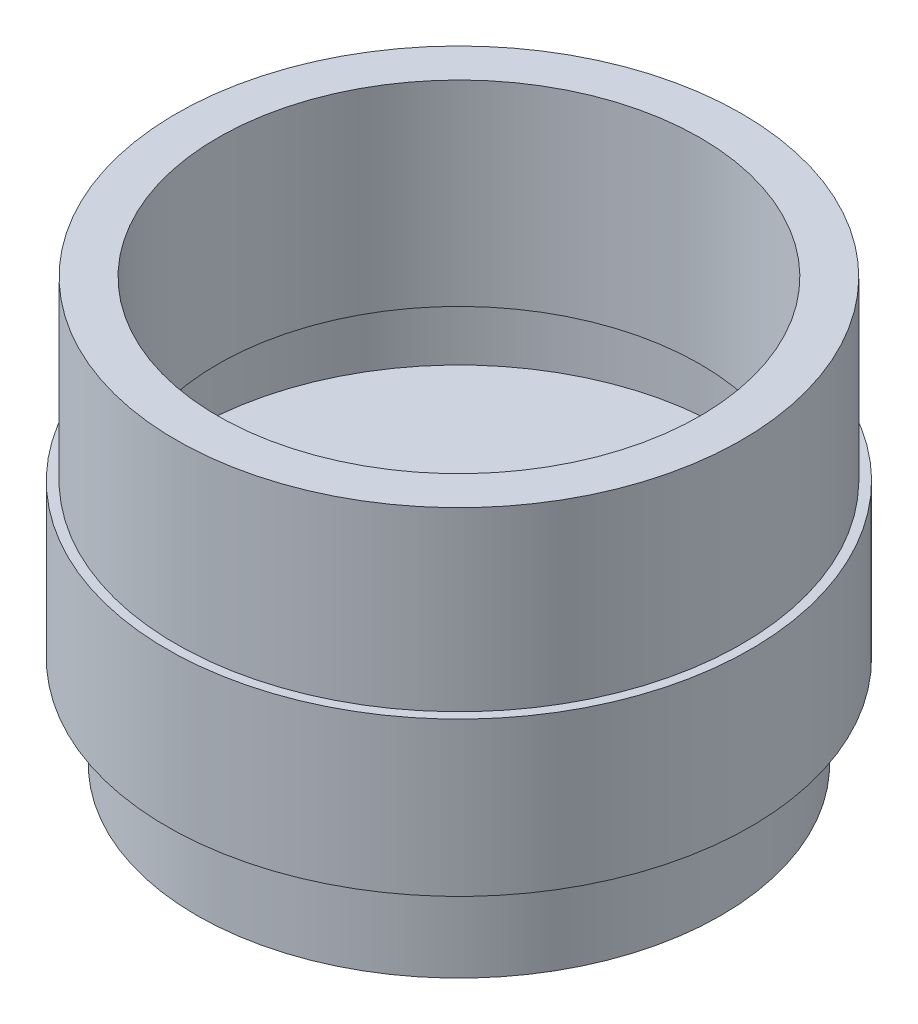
ISO-10303-21;
HEADER;
FILE_DESCRIPTION(('STEP AP214'),'2;1');
FILE_NAME('part.step','',(''),(''),'','','');
FILE_SCHEMA(('AUTOMOTIVE_DESIGN { 1 0 10303 214 1 1 1 1 }'));
ENDSEC;
DATA;
#1=APPLICATION_CONTEXT('core data for automotive mechanical design processes');
#2=APPLICATION_PROTOCOL_DEFINITION('international standard','automotive_design',2000,#1);
#3=PRODUCT_CONTEXT('',#1,'mechanical');
#4=PRODUCT('Part','Part','',(#3));
#5=PRODUCT_RELATED_PRODUCT_CATEGORY('part','',(#4));
#6=PRODUCT_DEFINITION_FORMATION('','',#4);
#7=PRODUCT_DEFINITION_CONTEXT('part definition',#1,'design');
#8=PRODUCT_DEFINITION('design','',#6,#7);
#9=PRODUCT_DEFINITION_SHAPE('','',#8);
#10=(LENGTH_UNIT() NAMED_UNIT(*) SI_UNIT(.MILLI.,.METRE.));
#11=(NAMED_UNIT(*) PLANE_ANGLE_UNIT() SI_UNIT($,.RADIAN.));
#12=(NAMED_UNIT(*) SI_UNIT($,.STERADIAN.) SOLID_ANGLE_UNIT());
#13=UNCERTAINTY_MEASURE_WITH_UNIT(LENGTH_MEASURE(1.E-05),#10,'distance_accuracy_value','');
#14=(GEOMETRIC_REPRESENTATION_CONTEXT(3) GLOBAL_UNCERTAINTY_ASSIGNED_CONTEXT((#13)) GLOBAL_UNIT_ASSIGNED_CONTEXT((#10,
#11,#12)) REPRESENTATION_CONTEXT('',''));
#15=CARTESIAN_POINT('',(0.,0.,0.));
#16=DIRECTION('',(0.,0.,1.));
#17=DIRECTION('',(1.,0.,0.));
#18=AXIS2_PLACEMENT_3D('',#15,#16,#17);
#19=CARTESIAN_POINT('',(0.,1.65735000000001,0.));
#20=DIRECTION('',(0.,-1.,0.));
#21=DIRECTION('',(0.,0.,-1.));
#22=AXIS2_PLACEMENT_3D('',#19,#20,#21);
#23=CONICAL_SURFACE('',#22,3.93065,0.785398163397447);
#24=CARTESIAN_POINT('',(0.,0.,0.));
#25=DIRECTION('',(0.,-1.,0.));
#26=DIRECTION('',(0.,0.,-1.));
#27=AXIS2_PLACEMENT_3D('',#24,#25,#26);
#28=CIRCLE('',#27,5.588);
#29=CARTESIAN_POINT('',(0.,0.,-5.588));
#30=VERTEX_POINT('',#29);
#31=EDGE_CURVE('E10',#30,#30,#28,.T.);
#32=ORIENTED_EDGE('',*,*,#31,.T.);
#33=EDGE_LOOP('',(#32));
#34=FACE_BOUND('',#33,.T.);
#35=CARTESIAN_POINT('',(0.,1.65735000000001,0.));
#36=DIRECTION('',(0.,-1.,0.));
#37=DIRECTION('',(0.,0.,-1.));
#38=AXIS2_PLACEMENT_3D('',#35,#36,#37);
#39=CIRCLE('',#38,3.93065);
#40=CARTESIAN_POINT('',(0.,1.65735000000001,-3.93065));
#41=VERTEX_POINT('',#40);
#42=EDGE_CURVE('E91',#41,#41,#39,.T.);
#43=ORIENTED_EDGE('',*,*,#42,.F.);
#44=EDGE_LOOP('',(#43));
#45=FACE_BOUND('',#44,.T.);
#46=ADVANCED_FACE('F36',(#34,#45),#23,.F.);
#47=CARTESIAN_POINT('',(5.588,0.,0.));
#48=DIRECTION('',(0.,-1.,0.));
#49=DIRECTION('',(0.,0.,-1.));
#50=AXIS2_PLACEMENT_3D('',#47,#48,#49);
#51=PLANE('',#50);
#52=CARTESIAN_POINT('',(0.,0.,0.));
#53=DIRECTION('',(0.,-1.,0.));
#54=DIRECTION('',(0.,0.,-1.));
#55=AXIS2_PLACEMENT_3D('',#52,#53,#54);
#56=CIRCLE('',#55,7.9121);
#57=CARTESIAN_POINT('',(0.,0.,-7.9121));
#58=VERTEX_POINT('',#57);
#59=EDGE_CURVE('E43',#58,#58,#56,.T.);
#60=ORIENTED_EDGE('',*,*,#59,.T.);
#61=EDGE_LOOP('',(#60));
#62=FACE_BOUND('',#61,.T.);
#63=ORIENTED_EDGE('',*,*,#31,.F.);
#64=EDGE_LOOP('',(#63));
#65=FACE_BOUND('',#64,.T.);
#66=ADVANCED_FACE('F100',(#62,#65),#51,.T.);
#67=CARTESIAN_POINT('',(0.,0.,0.));
#68=DIRECTION('',(0.,-1.,0.));
#69=DIRECTION('',(0.,0.,-1.));
#70=AXIS2_PLACEMENT_3D('',#67,#68,#69);
#71=CYLINDRICAL_SURFACE('',#70,7.9121);
#72=CARTESIAN_POINT('',(0.,2.7686,0.));
#73=DIRECTION('',(0.,-1.,0.));
#74=DIRECTION('',(0.,0.,-1.));
#75=AXIS2_PLACEMENT_3D('',#72,#73,#74);
#76=CIRCLE('',#75,7.9121);
#77=CARTESIAN_POINT('',(0.,2.7686,-7.9121));
#78=VERTEX_POINT('',#77);
#79=EDGE_CURVE('E48',#78,#78,#76,.T.);
#80=ORIENTED_EDGE('',*,*,#79,.T.);
#81=EDGE_LOOP('',(#80));
#82=FACE_BOUND('',#81,.T.);
#83=ORIENTED_EDGE('',*,*,#59,.F.);
#84=EDGE_LOOP('',(#83));
#85=FACE_BOUND('',#84,.T.);
#86=ADVANCED_FACE('F104',(#82,#85),#71,.T.);
#87=CARTESIAN_POINT('',(7.9121,2.7686,0.));
#88=DIRECTION('',(0.,-1.,0.));
#89=DIRECTION('',(0.,0.,-1.));
#90=AXIS2_PLACEMENT_3D('',#87,#88,#89);
#91=PLANE('',#90);
#92=CARTESIAN_POINT('',(0.,2.7686,0.));
#93=DIRECTION('',(0.,-1.,0.));
#94=DIRECTION('',(0.,0.,-1.));
#95=AXIS2_PLACEMENT_3D('',#92,#93,#94);
#96=CIRCLE('',#95,8.80745);
#97=CARTESIAN_POINT('',(0.,2.7686,-8.80745));
#98=VERTEX_POINT('',#97);
#99=EDGE_CURVE('E53',#98,#98,#96,.T.);
#100=ORIENTED_EDGE('',*,*,#99,.T.);
#101=EDGE_LOOP('',(#100));
#102=FACE_BOUND('',#101,.T.);
#103=ORIENTED_EDGE('',*,*,#79,.F.);
#104=EDGE_LOOP('',(#103));
#105=FACE_BOUND('',#104,.T.);
#106=ADVANCED_FACE('F108',(#102,#105),#91,.T.);
#107=CARTESIAN_POINT('',(0.,0.,0.));
#108=DIRECTION('',(0.,-1.,0.));
#109=DIRECTION('',(0.,0.,-1.));
#110=AXIS2_PLACEMENT_3D('',#107,#108,#109);
#111=CYLINDRICAL_SURFACE('',#110,8.80745);
#112=CARTESIAN_POINT('',(0.,7.4041,0.));
#113=DIRECTION('',(0.,-1.,0.));
#114=DIRECTION('',(0.,0.,-1.));
#115=AXIS2_PLACEMENT_3D('',#112,#113,#114);
#116=CIRCLE('',#115,8.80745);
#117=CARTESIAN_POINT('',(0.,7.4041,-8.80745));
#118=VERTEX_POINT('',#117);
#119=EDGE_CURVE('E59',#118,#118,#116,.T.);
#120=ORIENTED_EDGE('',*,*,#119,.T.);
#121=EDGE_LOOP('',(#120));
#122=FACE_BOUND('',#121,.T.);
#123=ORIENTED_EDGE('',*,*,#99,.F.);
#124=EDGE_LOOP('',(#123));
#125=FACE_BOUND('',#124,.T.);
#126=ADVANCED_FACE('F115',(#122,#125),#111,.T.);
#127=CARTESIAN_POINT('',(8.80745,7.4041,0.));
#128=DIRECTION('',(0.,1.,0.));
#129=DIRECTION('',(0.,0.,1.));
#130=AXIS2_PLACEMENT_3D('',#127,#128,#129);
#131=PLANE('',#130);
#132=CARTESIAN_POINT('',(0.,7.4041,0.));
#133=DIRECTION('',(0.,-1.,0.));
#134=DIRECTION('',(0.,0.,-1.));
#135=AXIS2_PLACEMENT_3D('',#132,#133,#134);
#136=CIRCLE('',#135,8.5344);
#137=CARTESIAN_POINT('',(0.,7.4041,-8.5344));
#138=VERTEX_POINT('',#137);
#139=EDGE_CURVE('E63',#138,#138,#136,.T.);
#140=ORIENTED_EDGE('',*,*,#139,.T.);
#141=EDGE_LOOP('',(#140));
#142=FACE_BOUND('',#141,.T.);
#143=ORIENTED_EDGE('',*,*,#119,.F.);
#144=EDGE_LOOP('',(#143));
#145=FACE_BOUND('',#144,.T.);
#146=ADVANCED_FACE('F119',(#142,#145),#131,.T.);
#147=CARTESIAN_POINT('',(0.,0.,0.));
#148=DIRECTION('',(0.,-1.,0.));
#149=DIRECTION('',(0.,0.,-1.));
#150=AXIS2_PLACEMENT_3D('',#147,#148,#149);
#151=CYLINDRICAL_SURFACE('',#150,8.5344);
#152=CARTESIAN_POINT('',(0.,12.7381,0.));
#153=DIRECTION('',(0.,-1.,0.));
#154=DIRECTION('',(0.,0.,-1.));
#155=AXIS2_PLACEMENT_3D('',#152,#153,#154);
#156=CIRCLE('',#155,8.5344);
#157=CARTESIAN_POINT('',(0.,12.7381,-8.5344));
#158=VERTEX_POINT('',#157);
#159=EDGE_CURVE('E67',#158,#158,#156,.T.);
#160=ORIENTED_EDGE('',*,*,#159,.T.);
#161=EDGE_LOOP('',(#160));
#162=FACE_BOUND('',#161,.T.);
#163=ORIENTED_EDGE('',*,*,#139,.F.);
#164=EDGE_LOOP('',(#163));
#165=FACE_BOUND('',#164,.T.);
#166=ADVANCED_FACE('F123',(#162,#165),#151,.T.);
#167=CARTESIAN_POINT('',(8.5344,12.7381,0.));
#168=DIRECTION('',(0.,1.,0.));
#169=DIRECTION('',(0.,0.,1.));
#170=AXIS2_PLACEMENT_3D('',#167,#168,#169);
#171=PLANE('',#170);
#172=CARTESIAN_POINT('',(0.,12.7381,0.));
#173=DIRECTION('',(0.,-1.,0.));
#174=DIRECTION('',(0.,0.,-1.));
#175=AXIS2_PLACEMENT_3D('',#172,#173,#174);
#176=CIRCLE('',#175,7.2771);
#177=CARTESIAN_POINT('',(0.,12.7381,-7.2771));
#178=VERTEX_POINT('',#177);
#179=EDGE_CURVE('E71',#178,#178,#176,.T.);
#180=ORIENTED_EDGE('',*,*,#179,.T.);
#181=EDGE_LOOP('',(#180));
#182=FACE_BOUND('',#181,.T.);
#183=ORIENTED_EDGE('',*,*,#159,.F.);
#184=EDGE_LOOP('',(#183));
#185=FACE_BOUND('',#184,.T.);
#186=ADVANCED_FACE('F127',(#182,#185),#171,.T.);
#187=CARTESIAN_POINT('',(0.,0.,0.));
#188=DIRECTION('',(0.,-1.,0.));
#189=DIRECTION('',(0.,0.,-1.));
#190=AXIS2_PLACEMENT_3D('',#187,#188,#189);
#191=CYLINDRICAL_SURFACE('',#190,7.2771);
#192=CARTESIAN_POINT('',(0.,6.8199,0.));
#193=DIRECTION('',(0.,-1.,0.));
#194=DIRECTION('',(0.,0.,-1.));
#195=AXIS2_PLACEMENT_3D('',#192,#193,#194);
#196=CIRCLE('',#195,7.2771);
#197=CARTESIAN_POINT('',(0.,6.8199,-7.2771));
#198=VERTEX_POINT('',#197);
#199=EDGE_CURVE('E75',#198,#198,#196,.T.);
#200=ORIENTED_EDGE('',*,*,#199,.T.);
#201=EDGE_LOOP('',(#200));
#202=FACE_BOUND('',#201,.T.);
#203=ORIENTED_EDGE('',*,*,#179,.F.);
#204=EDGE_LOOP('',(#203));
#205=FACE_BOUND('',#204,.T.);
#206=ADVANCED_FACE('F131',(#202,#205),#191,.F.);
#207=CARTESIAN_POINT('',(7.2771,6.8199,0.));
#208=DIRECTION('',(0.,-1.,0.));
#209=DIRECTION('',(0.,0.,-1.));
#210=AXIS2_PLACEMENT_3D('',#207,#208,#209);
#211=PLANE('',#210);
#212=CARTESIAN_POINT('',(0.,6.8199,0.));
#213=DIRECTION('',(0.,-1.,0.));
#214=DIRECTION('',(0.,0.,-1.));
#215=AXIS2_PLACEMENT_3D('',#212,#213,#214);
#216=CIRCLE('',#215,8.02005);
#217=CARTESIAN_POINT('',(0.,6.8199,-8.02005));
#218=VERTEX_POINT('',#217);
#219=EDGE_CURVE('E79',#218,#218,#216,.T.);
#220=ORIENTED_EDGE('',*,*,#219,.T.);
#221=EDGE_LOOP('',(#220));
#222=FACE_BOUND('',#221,.T.);
#223=ORIENTED_EDGE('',*,*,#199,.F.);
#224=EDGE_LOOP('',(#223));
#225=FACE_BOUND('',#224,.T.);
#226=ADVANCED_FACE('F135',(#222,#225),#211,.T.);
#227=CARTESIAN_POINT('',(0.,0.,0.));
#228=DIRECTION('',(0.,-1.,0.));
#229=DIRECTION('',(0.,0.,-1.));
#230=AXIS2_PLACEMENT_3D('',#227,#228,#229);
#231=CYLINDRICAL_SURFACE('',#230,8.02005);
#232=CARTESIAN_POINT('',(0.,4.7625,0.));
#233=DIRECTION('',(0.,-1.,0.));
#234=DIRECTION('',(0.,0.,-1.));
#235=AXIS2_PLACEMENT_3D('',#232,#233,#234);
#236=CIRCLE('',#235,8.02005);
#237=CARTESIAN_POINT('',(0.,4.7625,-8.02005));
#238=VERTEX_POINT('',#237);
#239=EDGE_CURVE('E83',#238,#238,#236,.T.);
#240=ORIENTED_EDGE('',*,*,#239,.T.);
#241=EDGE_LOOP('',(#240));
#242=FACE_BOUND('',#241,.T.);
#243=ORIENTED_EDGE('',*,*,#219,.F.);
#244=EDGE_LOOP('',(#243));
#245=FACE_BOUND('',#244,.T.);
#246=ADVANCED_FACE('F139',(#242,#245),#231,.F.);
#247=CARTESIAN_POINT('',(8.02005,4.7625,0.));
#248=DIRECTION('',(0.,1.,0.));
#249=DIRECTION('',(0.,0.,1.));
#250=AXIS2_PLACEMENT_3D('',#247,#248,#249);
#251=PLANE('',#250);
#252=CARTESIAN_POINT('',(0.,4.7625,0.));
#253=DIRECTION('',(0.,-1.,0.));
#254=DIRECTION('',(0.,0.,-1.));
#255=AXIS2_PLACEMENT_3D('',#252,#253,#254);
#256=CIRCLE('',#255,3.93065);
#257=CARTESIAN_POINT('',(0.,4.7625,-3.93065));
#258=VERTEX_POINT('',#257);
#259=EDGE_CURVE('E87',#258,#258,#256,.T.);
#260=ORIENTED_EDGE('',*,*,#259,.T.);
#261=EDGE_LOOP('',(#260));
#262=FACE_BOUND('',#261,.T.);
#263=ORIENTED_EDGE('',*,*,#239,.F.);
#264=EDGE_LOOP('',(#263));
#265=FACE_BOUND('',#264,.T.);
#266=ADVANCED_FACE('F143',(#262,#265),#251,.T.);
#267=CARTESIAN_POINT('',(0.,0.,0.));
#268=DIRECTION('',(0.,-1.,0.));
#269=DIRECTION('',(0.,0.,-1.));
#270=AXIS2_PLACEMENT_3D('',#267,#268,#269);
#271=CYLINDRICAL_SURFACE('',#270,3.93065);
#272=ORIENTED_EDGE('',*,*,#42,.T.);
#273=EDGE_LOOP('',(#272));
#274=FACE_BOUND('',#273,.T.);
#275=ORIENTED_EDGE('',*,*,#259,.F.);
#276=EDGE_LOOP('',(#275));
#277=FACE_BOUND('',#276,.T.);
#278=ADVANCED_FACE('F96',(#274,#277),#271,.F.);
#279=CLOSED_SHELL('',(#46,#66,#86,#106,#126,#146,#166,#186,#206,#226,#246,#266,#278));
#280=MANIFOLD_SOLID_BREP('B2',#279);
#281=ADVANCED_BREP_SHAPE_REPRESENTATION('',(#18,#280),#14);
#282=SHAPE_DEFINITION_REPRESENTATION(#9,#281);
ENDSEC;
END-ISO-10303-21;
